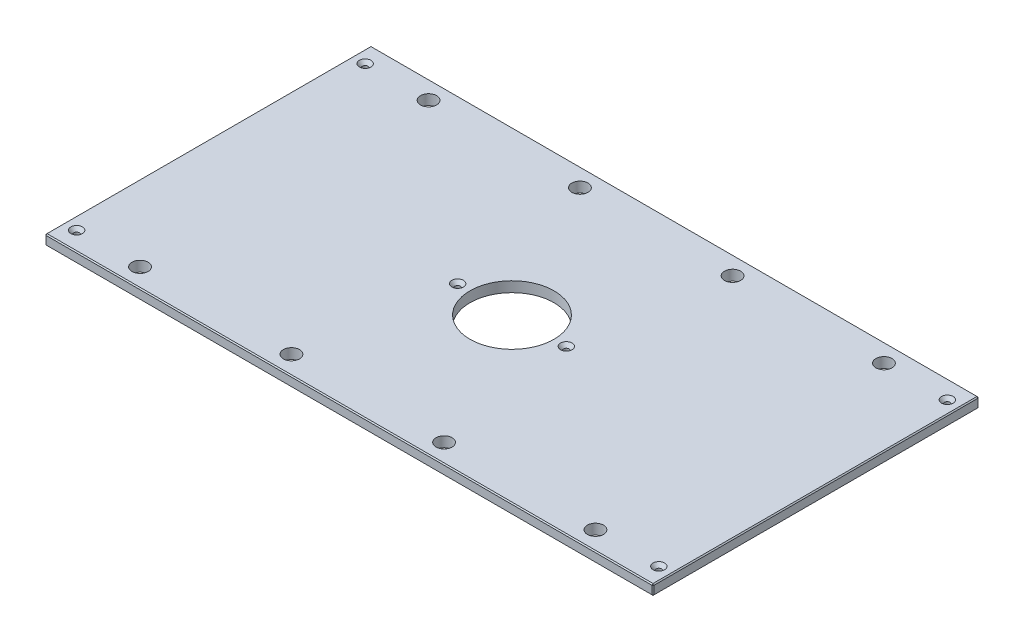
ISO-10303-21;
HEADER;
FILE_DESCRIPTION(('STEP AP214'),'2;1');
FILE_NAME('part.step','',(''),(''),'','','');
FILE_SCHEMA(('AUTOMOTIVE_DESIGN { 1 0 10303 214 1 1 1 1 }'));
ENDSEC;
DATA;
#1=APPLICATION_CONTEXT('core data for automotive mechanical design processes');
#2=APPLICATION_PROTOCOL_DEFINITION('international standard','automotive_design',2000,#1);
#3=PRODUCT_CONTEXT('',#1,'mechanical');
#4=PRODUCT('Part','Part','',(#3));
#5=PRODUCT_RELATED_PRODUCT_CATEGORY('part','',(#4));
#6=PRODUCT_DEFINITION_FORMATION('','',#4);
#7=PRODUCT_DEFINITION_CONTEXT('part definition',#1,'design');
#8=PRODUCT_DEFINITION('design','',#6,#7);
#9=PRODUCT_DEFINITION_SHAPE('','',#8);
#10=(LENGTH_UNIT() NAMED_UNIT(*) SI_UNIT(.MILLI.,.METRE.));
#11=(NAMED_UNIT(*) PLANE_ANGLE_UNIT() SI_UNIT($,.RADIAN.));
#12=(NAMED_UNIT(*) SI_UNIT($,.STERADIAN.) SOLID_ANGLE_UNIT());
#13=UNCERTAINTY_MEASURE_WITH_UNIT(LENGTH_MEASURE(1.E-05),#10,'distance_accuracy_value','');
#14=(GEOMETRIC_REPRESENTATION_CONTEXT(3) GLOBAL_UNCERTAINTY_ASSIGNED_CONTEXT((#13)) GLOBAL_UNIT_ASSIGNED_CONTEXT((#10,
#11,#12)) REPRESENTATION_CONTEXT('',''));
#15=CARTESIAN_POINT('',(0.,0.,0.));
#16=DIRECTION('',(0.,0.,1.));
#17=DIRECTION('',(1.,0.,0.));
#18=AXIS2_PLACEMENT_3D('',#15,#16,#17);
#19=CARTESIAN_POINT('',(-373.0625,12.7,-200.025));
#20=DIRECTION('',(1.,0.,0.));
#21=DIRECTION('',(0.,0.,-1.));
#22=AXIS2_PLACEMENT_3D('',#19,#20,#21);
#23=PLANE('',#22);
#24=DIRECTION('',(0.,0.,-1.));
#25=VECTOR('',#24,1.);
#26=CARTESIAN_POINT('',(-373.0625,11.43,-200.025));
#27=LINE('',#26,#25);
#28=CARTESIAN_POINT('',(-373.0625,11.43,198.755));
#29=VERTEX_POINT('',#28);
#30=CARTESIAN_POINT('',(-373.0625,11.43,-198.755));
#31=VERTEX_POINT('',#30);
#32=EDGE_CURVE('E135',#29,#31,#27,.T.);
#33=ORIENTED_EDGE('',*,*,#32,.T.);
#34=DIRECTION('',(0.,-1.,0.));
#35=VECTOR('',#34,1.);
#36=CARTESIAN_POINT('',(-373.0625,12.7,-198.755));
#37=LINE('',#36,#35);
#38=CARTESIAN_POINT('',(-373.0625,1.26999999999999,-198.755));
#39=VERTEX_POINT('',#38);
#40=EDGE_CURVE('E131',#31,#39,#37,.T.);
#41=ORIENTED_EDGE('',*,*,#40,.T.);
#42=DIRECTION('',(0.,0.,1.));
#43=VECTOR('',#42,1.);
#44=CARTESIAN_POINT('',(-373.0625,1.26999999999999,-200.025));
#45=LINE('',#44,#43);
#46=CARTESIAN_POINT('',(-373.0625,1.26999999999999,198.755));
#47=VERTEX_POINT('',#46);
#48=EDGE_CURVE('E126',#39,#47,#45,.T.);
#49=ORIENTED_EDGE('',*,*,#48,.T.);
#50=DIRECTION('',(0.,1.,0.));
#51=VECTOR('',#50,1.);
#52=CARTESIAN_POINT('',(-373.0625,12.7,198.755));
#53=LINE('',#52,#51);
#54=EDGE_CURVE('E128',#47,#29,#53,.T.);
#55=ORIENTED_EDGE('',*,*,#54,.T.);
#56=EDGE_LOOP('',(#33,#41,#49,#55));
#57=FACE_BOUND('',#56,.T.);
#58=ADVANCED_FACE('F35',(#57),#23,.F.);
#59=CARTESIAN_POINT('',(-373.0625,12.7,200.025));
#60=DIRECTION('',(0.,0.,-1.));
#61=DIRECTION('',(-1.,0.,0.));
#62=AXIS2_PLACEMENT_3D('',#59,#60,#61);
#63=PLANE('',#62);
#64=DIRECTION('',(1.,0.,0.));
#65=VECTOR('',#64,1.);
#66=CARTESIAN_POINT('',(-373.0625,1.26999999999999,200.025));
#67=LINE('',#66,#65);
#68=CARTESIAN_POINT('',(-371.7925,1.26999999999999,200.025));
#69=VERTEX_POINT('',#68);
#70=CARTESIAN_POINT('',(371.7925,1.26999999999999,200.025));
#71=VERTEX_POINT('',#70);
#72=EDGE_CURVE('E58',#69,#71,#67,.T.);
#73=ORIENTED_EDGE('',*,*,#72,.T.);
#74=DIRECTION('',(0.,1.,0.));
#75=VECTOR('',#74,1.);
#76=CARTESIAN_POINT('',(371.7925,12.7,200.025));
#77=LINE('',#76,#75);
#78=CARTESIAN_POINT('',(371.7925,11.43,200.025));
#79=VERTEX_POINT('',#78);
#80=EDGE_CURVE('E11',#71,#79,#77,.T.);
#81=ORIENTED_EDGE('',*,*,#80,.T.);
#82=DIRECTION('',(-1.,0.,0.));
#83=VECTOR('',#82,1.);
#84=CARTESIAN_POINT('',(-373.0625,11.43,200.025));
#85=LINE('',#84,#83);
#86=CARTESIAN_POINT('',(-371.7925,11.43,200.025));
#87=VERTEX_POINT('',#86);
#88=EDGE_CURVE('E44',#79,#87,#85,.T.);
#89=ORIENTED_EDGE('',*,*,#88,.T.);
#90=DIRECTION('',(0.,-1.,0.));
#91=VECTOR('',#90,1.);
#92=CARTESIAN_POINT('',(-371.7925,12.7,200.025));
#93=LINE('',#92,#91);
#94=EDGE_CURVE('E303',#87,#69,#93,.T.);
#95=ORIENTED_EDGE('',*,*,#94,.T.);
#96=EDGE_LOOP('',(#73,#81,#89,#95));
#97=FACE_BOUND('',#96,.T.);
#98=ADVANCED_FACE('F372',(#97),#63,.F.);
#99=CARTESIAN_POINT('',(373.0625,12.7,-200.025));
#100=DIRECTION('',(-1.,0.,0.));
#101=DIRECTION('',(0.,0.,1.));
#102=AXIS2_PLACEMENT_3D('',#99,#100,#101);
#103=PLANE('',#102);
#104=DIRECTION('',(0.,0.,-1.));
#105=VECTOR('',#104,1.);
#106=CARTESIAN_POINT('',(373.0625,1.26999999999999,-200.025));
#107=LINE('',#106,#105);
#108=CARTESIAN_POINT('',(373.0625,1.26999999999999,198.755));
#109=VERTEX_POINT('',#108);
#110=CARTESIAN_POINT('',(373.0625,1.26999999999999,-198.755));
#111=VERTEX_POINT('',#110);
#112=EDGE_CURVE('E298',#109,#111,#107,.T.);
#113=ORIENTED_EDGE('',*,*,#112,.T.);
#114=DIRECTION('',(0.,1.,0.));
#115=VECTOR('',#114,1.);
#116=CARTESIAN_POINT('',(373.0625,12.7,-198.755));
#117=LINE('',#116,#115);
#118=CARTESIAN_POINT('',(373.0625,11.43,-198.755));
#119=VERTEX_POINT('',#118);
#120=EDGE_CURVE('E300',#111,#119,#117,.T.);
#121=ORIENTED_EDGE('',*,*,#120,.T.);
#122=DIRECTION('',(0.,0.,1.));
#123=VECTOR('',#122,1.);
#124=CARTESIAN_POINT('',(373.0625,11.43,200.025));
#125=LINE('',#124,#123);
#126=CARTESIAN_POINT('',(373.0625,11.43,198.755));
#127=VERTEX_POINT('',#126);
#128=EDGE_CURVE('E296',#119,#127,#125,.T.);
#129=ORIENTED_EDGE('',*,*,#128,.T.);
#130=DIRECTION('',(0.,-1.,0.));
#131=VECTOR('',#130,1.);
#132=CARTESIAN_POINT('',(373.0625,12.7,198.755));
#133=LINE('',#132,#131);
#134=EDGE_CURVE('E294',#127,#109,#133,.T.);
#135=ORIENTED_EDGE('',*,*,#134,.T.);
#136=EDGE_LOOP('',(#113,#121,#129,#135));
#137=FACE_BOUND('',#136,.T.);
#138=ADVANCED_FACE('F359',(#137),#103,.F.);
#139=CARTESIAN_POINT('',(-373.0625,12.7,-200.025));
#140=DIRECTION('',(0.,0.,1.));
#141=DIRECTION('',(1.,0.,0.));
#142=AXIS2_PLACEMENT_3D('',#139,#140,#141);
#143=PLANE('',#142);
#144=DIRECTION('',(-1.,0.,0.));
#145=VECTOR('',#144,1.);
#146=CARTESIAN_POINT('',(-373.0625,1.26999999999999,-200.025));
#147=LINE('',#146,#145);
#148=CARTESIAN_POINT('',(371.7925,1.26999999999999,-200.025));
#149=VERTEX_POINT('',#148);
#150=CARTESIAN_POINT('',(-371.7925,1.26999999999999,-200.025));
#151=VERTEX_POINT('',#150);
#152=EDGE_CURVE('E270',#149,#151,#147,.T.);
#153=ORIENTED_EDGE('',*,*,#152,.T.);
#154=DIRECTION('',(0.,1.,0.));
#155=VECTOR('',#154,1.);
#156=CARTESIAN_POINT('',(-371.7925,12.7,-200.025));
#157=LINE('',#156,#155);
#158=CARTESIAN_POINT('',(-371.7925,11.43,-200.025));
#159=VERTEX_POINT('',#158);
#160=EDGE_CURVE('E274',#151,#159,#157,.T.);
#161=ORIENTED_EDGE('',*,*,#160,.T.);
#162=DIRECTION('',(1.,0.,0.));
#163=VECTOR('',#162,1.);
#164=CARTESIAN_POINT('',(373.0625,11.43,-200.025));
#165=LINE('',#164,#163);
#166=CARTESIAN_POINT('',(371.7925,11.43,-200.025));
#167=VERTEX_POINT('',#166);
#168=EDGE_CURVE('E272',#159,#167,#165,.T.);
#169=ORIENTED_EDGE('',*,*,#168,.T.);
#170=DIRECTION('',(0.,-1.,0.));
#171=VECTOR('',#170,1.);
#172=CARTESIAN_POINT('',(371.7925,12.7,-200.025));
#173=LINE('',#172,#171);
#174=EDGE_CURVE('E268',#167,#149,#173,.T.);
#175=ORIENTED_EDGE('',*,*,#174,.T.);
#176=EDGE_LOOP('',(#153,#161,#169,#175));
#177=FACE_BOUND('',#176,.T.);
#178=ADVANCED_FACE('F333',(#177),#143,.F.);
#179=CARTESIAN_POINT('',(0.,12.7,0.));
#180=DIRECTION('',(0.,1.,0.));
#181=DIRECTION('',(0.,0.,1.));
#182=AXIS2_PLACEMENT_3D('',#179,#180,#181);
#183=PLANE('',#182);
#184=CARTESIAN_POINT('',(357.1875,12.7,-177.00498));
#185=DIRECTION('',(0.,1.,0.));
#186=DIRECTION('',(0.,0.,1.));
#187=AXIS2_PLACEMENT_3D('',#184,#185,#186);
#188=CIRCLE('',#187,7.13740000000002);
#189=CARTESIAN_POINT('',(357.1875,12.7,-169.86758));
#190=VERTEX_POINT('',#189);
#191=EDGE_CURVE('E816',#190,#190,#188,.T.);
#192=ORIENTED_EDGE('',*,*,#191,.F.);
#193=EDGE_LOOP('',(#192));
#194=FACE_BOUND('',#193,.T.);
#195=CARTESIAN_POINT('',(357.1875,12.7,177.00498));
#196=DIRECTION('',(0.,1.,0.));
#197=DIRECTION('',(0.,0.,1.));
#198=AXIS2_PLACEMENT_3D('',#195,#196,#197);
#199=CIRCLE('',#198,7.13740000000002);
#200=CARTESIAN_POINT('',(357.1875,12.7,184.14238));
#201=VERTEX_POINT('',#200);
#202=EDGE_CURVE('E820',#201,#201,#199,.T.);
#203=ORIENTED_EDGE('',*,*,#202,.F.);
#204=EDGE_LOOP('',(#203));
#205=FACE_BOUND('',#204,.T.);
#206=CARTESIAN_POINT('',(-357.1875,12.7,177.00498));
#207=DIRECTION('',(0.,1.,0.));
#208=DIRECTION('',(0.,0.,1.));
#209=AXIS2_PLACEMENT_3D('',#206,#207,#208);
#210=CIRCLE('',#209,7.13740000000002);
#211=CARTESIAN_POINT('',(-357.1875,12.7,184.14238));
#212=VERTEX_POINT('',#211);
#213=EDGE_CURVE('E824',#212,#212,#210,.T.);
#214=ORIENTED_EDGE('',*,*,#213,.F.);
#215=EDGE_LOOP('',(#214));
#216=FACE_BOUND('',#215,.T.);
#217=CARTESIAN_POINT('',(-66.675,12.7,0.));
#218=DIRECTION('',(0.,1.,0.));
#219=DIRECTION('',(0.,0.,1.));
#220=AXIS2_PLACEMENT_3D('',#217,#218,#219);
#221=CIRCLE('',#220,7.1374);
#222=CARTESIAN_POINT('',(-66.675,12.7,7.1374));
#223=VERTEX_POINT('',#222);
#224=EDGE_CURVE('E828',#223,#223,#221,.T.);
#225=ORIENTED_EDGE('',*,*,#224,.F.);
#226=EDGE_LOOP('',(#225));
#227=FACE_BOUND('',#226,.T.);
#228=CARTESIAN_POINT('',(66.675,12.7,0.));
#229=DIRECTION('',(0.,1.,0.));
#230=DIRECTION('',(0.,0.,1.));
#231=AXIS2_PLACEMENT_3D('',#228,#229,#230);
#232=CIRCLE('',#231,7.1374);
#233=CARTESIAN_POINT('',(66.675,12.7,7.1374));
#234=VERTEX_POINT('',#233);
#235=EDGE_CURVE('E832',#234,#234,#232,.T.);
#236=ORIENTED_EDGE('',*,*,#235,.F.);
#237=EDGE_LOOP('',(#236));
#238=FACE_BOUND('',#237,.T.);
#239=CARTESIAN_POINT('',(-357.1875,12.7,-177.00498));
#240=DIRECTION('',(0.,1.,0.));
#241=DIRECTION('',(0.,0.,1.));
#242=AXIS2_PLACEMENT_3D('',#239,#240,#241);
#243=CIRCLE('',#242,7.13740000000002);
#244=CARTESIAN_POINT('',(-357.1875,12.7,-169.86758));
#245=VERTEX_POINT('',#244);
#246=EDGE_CURVE('E835',#245,#245,#243,.T.);
#247=ORIENTED_EDGE('',*,*,#246,.F.);
#248=EDGE_LOOP('',(#247));
#249=FACE_BOUND('',#248,.T.);
#250=DIRECTION('',(0.,0.,-1.));
#251=VECTOR('',#250,1.);
#252=CARTESIAN_POINT('',(371.7925,12.7,-200.025));
#253=LINE('',#252,#251);
#254=CARTESIAN_POINT('',(371.7925,12.7,198.755));
#255=VERTEX_POINT('',#254);
#256=CARTESIAN_POINT('',(371.7925,12.7,-198.755));
#257=VERTEX_POINT('',#256);
#258=EDGE_CURVE('E281',#255,#257,#253,.T.);
#259=ORIENTED_EDGE('',*,*,#258,.T.);
#260=DIRECTION('',(-1.,0.,0.));
#261=VECTOR('',#260,1.);
#262=CARTESIAN_POINT('',(-373.0625,12.7,-198.755));
#263=LINE('',#262,#261);
#264=CARTESIAN_POINT('',(-371.7925,12.7,-198.755));
#265=VERTEX_POINT('',#264);
#266=EDGE_CURVE('E283',#257,#265,#263,.T.);
#267=ORIENTED_EDGE('',*,*,#266,.T.);
#268=DIRECTION('',(0.,0.,1.));
#269=VECTOR('',#268,1.);
#270=CARTESIAN_POINT('',(-371.7925,12.7,200.025));
#271=LINE('',#270,#269);
#272=CARTESIAN_POINT('',(-371.7925,12.7,198.755));
#273=VERTEX_POINT('',#272);
#274=EDGE_CURVE('E279',#265,#273,#271,.T.);
#275=ORIENTED_EDGE('',*,*,#274,.T.);
#276=DIRECTION('',(1.,0.,0.));
#277=VECTOR('',#276,1.);
#278=CARTESIAN_POINT('',(373.0625,12.7,198.755));
#279=LINE('',#278,#277);
#280=EDGE_CURVE('E277',#273,#255,#279,.T.);
#281=ORIENTED_EDGE('',*,*,#280,.T.);
#282=EDGE_LOOP('',(#259,#267,#275,#281));
#283=FACE_BOUND('',#282,.T.);
#284=CARTESIAN_POINT('',(279.4,12.7,-177.00498));
#285=DIRECTION('',(0.,1.,0.));
#286=DIRECTION('',(0.,0.,1.));
#287=AXIS2_PLACEMENT_3D('',#284,#285,#286);
#288=CIRCLE('',#287,9.92187500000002);
#289=CARTESIAN_POINT('',(279.4,12.7,-167.083105));
#290=VERTEX_POINT('',#289);
#291=EDGE_CURVE('E204',#290,#290,#288,.T.);
#292=ORIENTED_EDGE('',*,*,#291,.F.);
#293=EDGE_LOOP('',(#292));
#294=FACE_BOUND('',#293,.T.);
#295=CARTESIAN_POINT('',(-279.4,12.7,-177.00498));
#296=DIRECTION('',(0.,1.,0.));
#297=DIRECTION('',(0.,0.,1.));
#298=AXIS2_PLACEMENT_3D('',#295,#296,#297);
#299=CIRCLE('',#298,9.92187500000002);
#300=CARTESIAN_POINT('',(-279.4,12.7,-167.083105));
#301=VERTEX_POINT('',#300);
#302=EDGE_CURVE('E214',#301,#301,#299,.T.);
#303=ORIENTED_EDGE('',*,*,#302,.F.);
#304=EDGE_LOOP('',(#303));
#305=FACE_BOUND('',#304,.T.);
#306=CARTESIAN_POINT('',(279.4,12.7,177.00498));
#307=DIRECTION('',(0.,1.,0.));
#308=DIRECTION('',(0.,0.,1.));
#309=AXIS2_PLACEMENT_3D('',#306,#307,#308);
#310=CIRCLE('',#309,9.92187500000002);
#311=CARTESIAN_POINT('',(279.4,12.7,186.926855));
#312=VERTEX_POINT('',#311);
#313=EDGE_CURVE('E225',#312,#312,#310,.T.);
#314=ORIENTED_EDGE('',*,*,#313,.F.);
#315=EDGE_LOOP('',(#314));
#316=FACE_BOUND('',#315,.T.);
#317=CARTESIAN_POINT('',(-279.4,12.7,177.00498));
#318=DIRECTION('',(0.,1.,0.));
#319=DIRECTION('',(0.,0.,1.));
#320=AXIS2_PLACEMENT_3D('',#317,#318,#319);
#321=CIRCLE('',#320,9.92187500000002);
#322=CARTESIAN_POINT('',(-279.4,12.7,186.926855));
#323=VERTEX_POINT('',#322);
#324=EDGE_CURVE('E231',#323,#323,#321,.T.);
#325=ORIENTED_EDGE('',*,*,#324,.F.);
#326=EDGE_LOOP('',(#325));
#327=FACE_BOUND('',#326,.T.);
#328=CARTESIAN_POINT('',(-93.6625,12.7,-177.00498));
#329=DIRECTION('',(0.,1.,0.));
#330=DIRECTION('',(0.,0.,1.));
#331=AXIS2_PLACEMENT_3D('',#328,#329,#330);
#332=CIRCLE('',#331,9.921875);
#333=CARTESIAN_POINT('',(-93.6625,12.7,-167.083105));
#334=VERTEX_POINT('',#333);
#335=EDGE_CURVE('E237',#334,#334,#332,.T.);
#336=ORIENTED_EDGE('',*,*,#335,.F.);
#337=EDGE_LOOP('',(#336));
#338=FACE_BOUND('',#337,.T.);
#339=CARTESIAN_POINT('',(93.6625,12.7,-177.00498));
#340=DIRECTION('',(0.,1.,0.));
#341=DIRECTION('',(0.,0.,1.));
#342=AXIS2_PLACEMENT_3D('',#339,#340,#341);
#343=CIRCLE('',#342,9.921875);
#344=CARTESIAN_POINT('',(93.6625,12.7,-167.083105));
#345=VERTEX_POINT('',#344);
#346=EDGE_CURVE('E243',#345,#345,#343,.T.);
#347=ORIENTED_EDGE('',*,*,#346,.F.);
#348=EDGE_LOOP('',(#347));
#349=FACE_BOUND('',#348,.T.);
#350=CARTESIAN_POINT('',(93.6625,12.7,177.00498));
#351=DIRECTION('',(0.,1.,0.));
#352=DIRECTION('',(0.,0.,1.));
#353=AXIS2_PLACEMENT_3D('',#350,#351,#352);
#354=CIRCLE('',#353,9.921875);
#355=CARTESIAN_POINT('',(93.6625,12.7,186.926855));
#356=VERTEX_POINT('',#355);
#357=EDGE_CURVE('E249',#356,#356,#354,.T.);
#358=ORIENTED_EDGE('',*,*,#357,.F.);
#359=EDGE_LOOP('',(#358));
#360=FACE_BOUND('',#359,.T.);
#361=CARTESIAN_POINT('',(-93.6625,12.7,177.00498));
#362=DIRECTION('',(0.,1.,0.));
#363=DIRECTION('',(0.,0.,1.));
#364=AXIS2_PLACEMENT_3D('',#361,#362,#363);
#365=CIRCLE('',#364,9.921875);
#366=CARTESIAN_POINT('',(-93.6625,12.7,186.926855));
#367=VERTEX_POINT('',#366);
#368=EDGE_CURVE('E255',#367,#367,#365,.T.);
#369=ORIENTED_EDGE('',*,*,#368,.F.);
#370=EDGE_LOOP('',(#369));
#371=FACE_BOUND('',#370,.T.);
#372=CARTESIAN_POINT('',(0.,12.7,0.));
#373=DIRECTION('',(0.,1.,0.));
#374=DIRECTION('',(0.,0.,1.));
#375=AXIS2_PLACEMENT_3D('',#372,#373,#374);
#376=CIRCLE('',#375,51.562);
#377=CARTESIAN_POINT('',(0.,12.7,51.562));
#378=VERTEX_POINT('',#377);
#379=EDGE_CURVE('E261',#378,#378,#376,.T.);
#380=ORIENTED_EDGE('',*,*,#379,.F.);
#381=EDGE_LOOP('',(#380));
#382=FACE_BOUND('',#381,.T.);
#383=ADVANCED_FACE('F381',(#194,#205,#216,#227,#238,#249,#283,#294,#305,#316,#327,#338,#349,
#360,#371,#382),#183,.T.);
#384=CARTESIAN_POINT('',(0.,0.,0.));
#385=DIRECTION('',(0.,1.,0.));
#386=DIRECTION('',(0.,0.,1.));
#387=AXIS2_PLACEMENT_3D('',#384,#385,#386);
#388=PLANE('',#387);
#389=CARTESIAN_POINT('',(357.1875,0.,-177.00498));
#390=DIRECTION('',(0.,1.,0.));
#391=DIRECTION('',(0.,0.,1.));
#392=AXIS2_PLACEMENT_3D('',#389,#390,#391);
#393=CIRCLE('',#392,3.3782);
#394=CARTESIAN_POINT('',(357.1875,0.,-173.62678));
#395=VERTEX_POINT('',#394);
#396=EDGE_CURVE('E869',#395,#395,#393,.T.);
#397=ORIENTED_EDGE('',*,*,#396,.T.);
#398=EDGE_LOOP('',(#397));
#399=FACE_BOUND('',#398,.T.);
#400=CARTESIAN_POINT('',(357.1875,0.,177.00498));
#401=DIRECTION('',(0.,1.,0.));
#402=DIRECTION('',(0.,0.,1.));
#403=AXIS2_PLACEMENT_3D('',#400,#401,#402);
#404=CIRCLE('',#403,3.3782);
#405=CARTESIAN_POINT('',(357.1875,0.,180.38318));
#406=VERTEX_POINT('',#405);
#407=EDGE_CURVE('E862',#406,#406,#404,.T.);
#408=ORIENTED_EDGE('',*,*,#407,.T.);
#409=EDGE_LOOP('',(#408));
#410=FACE_BOUND('',#409,.T.);
#411=CARTESIAN_POINT('',(-357.1875,0.,177.00498));
#412=DIRECTION('',(0.,1.,0.));
#413=DIRECTION('',(0.,0.,1.));
#414=AXIS2_PLACEMENT_3D('',#411,#412,#413);
#415=CIRCLE('',#414,3.3782);
#416=CARTESIAN_POINT('',(-357.1875,0.,180.38318));
#417=VERTEX_POINT('',#416);
#418=EDGE_CURVE('E855',#417,#417,#415,.T.);
#419=ORIENTED_EDGE('',*,*,#418,.T.);
#420=EDGE_LOOP('',(#419));
#421=FACE_BOUND('',#420,.T.);
#422=CARTESIAN_POINT('',(-66.675,0.,0.));
#423=DIRECTION('',(0.,1.,0.));
#424=DIRECTION('',(0.,0.,1.));
#425=AXIS2_PLACEMENT_3D('',#422,#423,#424);
#426=CIRCLE('',#425,3.3782);
#427=CARTESIAN_POINT('',(-66.675,0.,3.3782));
#428=VERTEX_POINT('',#427);
#429=EDGE_CURVE('E848',#428,#428,#426,.T.);
#430=ORIENTED_EDGE('',*,*,#429,.T.);
#431=EDGE_LOOP('',(#430));
#432=FACE_BOUND('',#431,.T.);
#433=CARTESIAN_POINT('',(66.675,0.,0.));
#434=DIRECTION('',(0.,1.,0.));
#435=DIRECTION('',(0.,0.,1.));
#436=AXIS2_PLACEMENT_3D('',#433,#434,#435);
#437=CIRCLE('',#436,3.3782);
#438=CARTESIAN_POINT('',(66.675,0.,3.3782));
#439=VERTEX_POINT('',#438);
#440=EDGE_CURVE('E838',#439,#439,#437,.T.);
#441=ORIENTED_EDGE('',*,*,#440,.T.);
#442=EDGE_LOOP('',(#441));
#443=FACE_BOUND('',#442,.T.);
#444=CARTESIAN_POINT('',(-357.1875,0.,-177.00498));
#445=DIRECTION('',(0.,1.,0.));
#446=DIRECTION('',(0.,0.,1.));
#447=AXIS2_PLACEMENT_3D('',#444,#445,#446);
#448=CIRCLE('',#447,3.3782);
#449=CARTESIAN_POINT('',(-357.1875,0.,-173.62678));
#450=VERTEX_POINT('',#449);
#451=EDGE_CURVE('E217',#450,#450,#448,.T.);
#452=ORIENTED_EDGE('',*,*,#451,.T.);
#453=EDGE_LOOP('',(#452));
#454=FACE_BOUND('',#453,.T.);
#455=DIRECTION('',(0.,0.,-1.));
#456=VECTOR('',#455,1.);
#457=CARTESIAN_POINT('',(-371.7925,0.,0.));
#458=LINE('',#457,#456);
#459=CARTESIAN_POINT('',(-371.7925,0.,198.755));
#460=VERTEX_POINT('',#459);
#461=CARTESIAN_POINT('',(-371.7925,0.,-198.755));
#462=VERTEX_POINT('',#461);
#463=EDGE_CURVE('E158',#460,#462,#458,.T.);
#464=ORIENTED_EDGE('',*,*,#463,.T.);
#465=DIRECTION('',(1.,0.,0.));
#466=VECTOR('',#465,1.);
#467=CARTESIAN_POINT('',(0.,0.,-198.755));
#468=LINE('',#467,#466);
#469=CARTESIAN_POINT('',(371.7925,0.,-198.755));
#470=VERTEX_POINT('',#469);
#471=EDGE_CURVE('E291',#462,#470,#468,.T.);
#472=ORIENTED_EDGE('',*,*,#471,.T.);
#473=DIRECTION('',(0.,0.,1.));
#474=VECTOR('',#473,1.);
#475=CARTESIAN_POINT('',(371.7925,0.,0.));
#476=LINE('',#475,#474);
#477=CARTESIAN_POINT('',(371.7925,0.,198.755));
#478=VERTEX_POINT('',#477);
#479=EDGE_CURVE('E289',#470,#478,#476,.T.);
#480=ORIENTED_EDGE('',*,*,#479,.T.);
#481=DIRECTION('',(-1.,0.,0.));
#482=VECTOR('',#481,1.);
#483=CARTESIAN_POINT('',(0.,0.,198.755));
#484=LINE('',#483,#482);
#485=EDGE_CURVE('E286',#478,#460,#484,.T.);
#486=ORIENTED_EDGE('',*,*,#485,.T.);
#487=EDGE_LOOP('',(#464,#472,#480,#486));
#488=FACE_BOUND('',#487,.T.);
#489=CARTESIAN_POINT('',(279.4,0.,-177.00498));
#490=DIRECTION('',(0.,1.,0.));
#491=DIRECTION('',(0.,0.,1.));
#492=AXIS2_PLACEMENT_3D('',#489,#490,#491);
#493=CIRCLE('',#492,9.92187500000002);
#494=CARTESIAN_POINT('',(279.4,0.,-167.083105));
#495=VERTEX_POINT('',#494);
#496=EDGE_CURVE('E209',#495,#495,#493,.T.);
#497=ORIENTED_EDGE('',*,*,#496,.T.);
#498=EDGE_LOOP('',(#497));
#499=FACE_BOUND('',#498,.T.);
#500=CARTESIAN_POINT('',(-279.4,0.,-177.00498));
#501=DIRECTION('',(0.,1.,0.));
#502=DIRECTION('',(0.,0.,1.));
#503=AXIS2_PLACEMENT_3D('',#500,#501,#502);
#504=CIRCLE('',#503,9.92187500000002);
#505=CARTESIAN_POINT('',(-279.4,0.,-167.083105));
#506=VERTEX_POINT('',#505);
#507=EDGE_CURVE('E222',#506,#506,#504,.T.);
#508=ORIENTED_EDGE('',*,*,#507,.T.);
#509=EDGE_LOOP('',(#508));
#510=FACE_BOUND('',#509,.T.);
#511=CARTESIAN_POINT('',(279.4,0.,177.00498));
#512=DIRECTION('',(0.,1.,0.));
#513=DIRECTION('',(0.,0.,1.));
#514=AXIS2_PLACEMENT_3D('',#511,#512,#513);
#515=CIRCLE('',#514,9.92187500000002);
#516=CARTESIAN_POINT('',(279.4,0.,186.926855));
#517=VERTEX_POINT('',#516);
#518=EDGE_CURVE('E228',#517,#517,#515,.T.);
#519=ORIENTED_EDGE('',*,*,#518,.T.);
#520=EDGE_LOOP('',(#519));
#521=FACE_BOUND('',#520,.T.);
#522=CARTESIAN_POINT('',(-279.4,0.,177.00498));
#523=DIRECTION('',(0.,1.,0.));
#524=DIRECTION('',(0.,0.,1.));
#525=AXIS2_PLACEMENT_3D('',#522,#523,#524);
#526=CIRCLE('',#525,9.92187500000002);
#527=CARTESIAN_POINT('',(-279.4,0.,186.926855));
#528=VERTEX_POINT('',#527);
#529=EDGE_CURVE('E234',#528,#528,#526,.T.);
#530=ORIENTED_EDGE('',*,*,#529,.T.);
#531=EDGE_LOOP('',(#530));
#532=FACE_BOUND('',#531,.T.);
#533=CARTESIAN_POINT('',(-93.6625,0.,-177.00498));
#534=DIRECTION('',(0.,1.,0.));
#535=DIRECTION('',(0.,0.,1.));
#536=AXIS2_PLACEMENT_3D('',#533,#534,#535);
#537=CIRCLE('',#536,9.921875);
#538=CARTESIAN_POINT('',(-93.6625,0.,-167.083105));
#539=VERTEX_POINT('',#538);
#540=EDGE_CURVE('E240',#539,#539,#537,.T.);
#541=ORIENTED_EDGE('',*,*,#540,.T.);
#542=EDGE_LOOP('',(#541));
#543=FACE_BOUND('',#542,.T.);
#544=CARTESIAN_POINT('',(93.6625,0.,-177.00498));
#545=DIRECTION('',(0.,1.,0.));
#546=DIRECTION('',(0.,0.,1.));
#547=AXIS2_PLACEMENT_3D('',#544,#545,#546);
#548=CIRCLE('',#547,9.921875);
#549=CARTESIAN_POINT('',(93.6625,0.,-167.083105));
#550=VERTEX_POINT('',#549);
#551=EDGE_CURVE('E246',#550,#550,#548,.T.);
#552=ORIENTED_EDGE('',*,*,#551,.T.);
#553=EDGE_LOOP('',(#552));
#554=FACE_BOUND('',#553,.T.);
#555=CARTESIAN_POINT('',(93.6625,0.,177.00498));
#556=DIRECTION('',(0.,1.,0.));
#557=DIRECTION('',(0.,0.,1.));
#558=AXIS2_PLACEMENT_3D('',#555,#556,#557);
#559=CIRCLE('',#558,9.921875);
#560=CARTESIAN_POINT('',(93.6625,0.,186.926855));
#561=VERTEX_POINT('',#560);
#562=EDGE_CURVE('E252',#561,#561,#559,.T.);
#563=ORIENTED_EDGE('',*,*,#562,.T.);
#564=EDGE_LOOP('',(#563));
#565=FACE_BOUND('',#564,.T.);
#566=CARTESIAN_POINT('',(-93.6625,0.,177.00498));
#567=DIRECTION('',(0.,1.,0.));
#568=DIRECTION('',(0.,0.,1.));
#569=AXIS2_PLACEMENT_3D('',#566,#567,#568);
#570=CIRCLE('',#569,9.921875);
#571=CARTESIAN_POINT('',(-93.6625,0.,186.926855));
#572=VERTEX_POINT('',#571);
#573=EDGE_CURVE('E258',#572,#572,#570,.T.);
#574=ORIENTED_EDGE('',*,*,#573,.T.);
#575=EDGE_LOOP('',(#574));
#576=FACE_BOUND('',#575,.T.);
#577=CARTESIAN_POINT('',(0.,0.,0.));
#578=DIRECTION('',(0.,1.,0.));
#579=DIRECTION('',(0.,0.,1.));
#580=AXIS2_PLACEMENT_3D('',#577,#578,#579);
#581=CIRCLE('',#580,51.562);
#582=CARTESIAN_POINT('',(0.,0.,51.562));
#583=VERTEX_POINT('',#582);
#584=EDGE_CURVE('E147',#583,#583,#581,.T.);
#585=ORIENTED_EDGE('',*,*,#584,.T.);
#586=EDGE_LOOP('',(#585));
#587=FACE_BOUND('',#586,.T.);
#588=ADVANCED_FACE('F346',(#399,#410,#421,#432,#443,#454,#488,#499,#510,#521,#532,#543,#554,
#565,#576,#587),#388,.F.);
#589=CARTESIAN_POINT('',(0.,0.,0.));
#590=DIRECTION('',(0.,1.,0.));
#591=DIRECTION('',(0.,0.,1.));
#592=AXIS2_PLACEMENT_3D('',#589,#590,#591);
#593=CYLINDRICAL_SURFACE('',#592,51.562);
#594=ORIENTED_EDGE('',*,*,#584,.F.);
#595=EDGE_LOOP('',(#594));
#596=FACE_BOUND('',#595,.T.);
#597=ORIENTED_EDGE('',*,*,#379,.T.);
#598=EDGE_LOOP('',(#597));
#599=FACE_BOUND('',#598,.T.);
#600=ADVANCED_FACE('F751',(#596,#599),#593,.F.);
#601=CARTESIAN_POINT('',(-93.6625,12.7,177.00498));
#602=DIRECTION('',(0.,1.,0.));
#603=DIRECTION('',(0.,0.,1.));
#604=AXIS2_PLACEMENT_3D('',#601,#602,#603);
#605=CYLINDRICAL_SURFACE('',#604,9.921875);
#606=ORIENTED_EDGE('',*,*,#573,.F.);
#607=EDGE_LOOP('',(#606));
#608=FACE_BOUND('',#607,.T.);
#609=ORIENTED_EDGE('',*,*,#368,.T.);
#610=EDGE_LOOP('',(#609));
#611=FACE_BOUND('',#610,.T.);
#612=ADVANCED_FACE('F742',(#608,#611),#605,.F.);
#613=CARTESIAN_POINT('',(93.6625,12.7,177.00498));
#614=DIRECTION('',(0.,1.,0.));
#615=DIRECTION('',(0.,0.,1.));
#616=AXIS2_PLACEMENT_3D('',#613,#614,#615);
#617=CYLINDRICAL_SURFACE('',#616,9.921875);
#618=ORIENTED_EDGE('',*,*,#562,.F.);
#619=EDGE_LOOP('',(#618));
#620=FACE_BOUND('',#619,.T.);
#621=ORIENTED_EDGE('',*,*,#357,.T.);
#622=EDGE_LOOP('',(#621));
#623=FACE_BOUND('',#622,.T.);
#624=ADVANCED_FACE('F733',(#620,#623),#617,.F.);
#625=CARTESIAN_POINT('',(93.6625,12.7,-177.00498));
#626=DIRECTION('',(0.,1.,0.));
#627=DIRECTION('',(0.,0.,1.));
#628=AXIS2_PLACEMENT_3D('',#625,#626,#627);
#629=CYLINDRICAL_SURFACE('',#628,9.921875);
#630=ORIENTED_EDGE('',*,*,#551,.F.);
#631=EDGE_LOOP('',(#630));
#632=FACE_BOUND('',#631,.T.);
#633=ORIENTED_EDGE('',*,*,#346,.T.);
#634=EDGE_LOOP('',(#633));
#635=FACE_BOUND('',#634,.T.);
#636=ADVANCED_FACE('F724',(#632,#635),#629,.F.);
#637=CARTESIAN_POINT('',(-93.6625,12.7,-177.00498));
#638=DIRECTION('',(0.,1.,0.));
#639=DIRECTION('',(0.,0.,1.));
#640=AXIS2_PLACEMENT_3D('',#637,#638,#639);
#641=CYLINDRICAL_SURFACE('',#640,9.921875);
#642=ORIENTED_EDGE('',*,*,#540,.F.);
#643=EDGE_LOOP('',(#642));
#644=FACE_BOUND('',#643,.T.);
#645=ORIENTED_EDGE('',*,*,#335,.T.);
#646=EDGE_LOOP('',(#645));
#647=FACE_BOUND('',#646,.T.);
#648=ADVANCED_FACE('F715',(#644,#647),#641,.F.);
#649=CARTESIAN_POINT('',(-279.4,12.7,177.00498));
#650=DIRECTION('',(0.,1.,0.));
#651=DIRECTION('',(0.,0.,1.));
#652=AXIS2_PLACEMENT_3D('',#649,#650,#651);
#653=CYLINDRICAL_SURFACE('',#652,9.92187500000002);
#654=ORIENTED_EDGE('',*,*,#529,.F.);
#655=EDGE_LOOP('',(#654));
#656=FACE_BOUND('',#655,.T.);
#657=ORIENTED_EDGE('',*,*,#324,.T.);
#658=EDGE_LOOP('',(#657));
#659=FACE_BOUND('',#658,.T.);
#660=ADVANCED_FACE('F706',(#656,#659),#653,.F.);
#661=CARTESIAN_POINT('',(279.4,12.7,177.00498));
#662=DIRECTION('',(0.,1.,0.));
#663=DIRECTION('',(0.,0.,1.));
#664=AXIS2_PLACEMENT_3D('',#661,#662,#663);
#665=CYLINDRICAL_SURFACE('',#664,9.92187500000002);
#666=ORIENTED_EDGE('',*,*,#518,.F.);
#667=EDGE_LOOP('',(#666));
#668=FACE_BOUND('',#667,.T.);
#669=ORIENTED_EDGE('',*,*,#313,.T.);
#670=EDGE_LOOP('',(#669));
#671=FACE_BOUND('',#670,.T.);
#672=ADVANCED_FACE('F697',(#668,#671),#665,.F.);
#673=CARTESIAN_POINT('',(-279.4,12.7,-177.00498));
#674=DIRECTION('',(0.,1.,0.));
#675=DIRECTION('',(0.,0.,1.));
#676=AXIS2_PLACEMENT_3D('',#673,#674,#675);
#677=CYLINDRICAL_SURFACE('',#676,9.92187500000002);
#678=ORIENTED_EDGE('',*,*,#507,.F.);
#679=EDGE_LOOP('',(#678));
#680=FACE_BOUND('',#679,.T.);
#681=ORIENTED_EDGE('',*,*,#302,.T.);
#682=EDGE_LOOP('',(#681));
#683=FACE_BOUND('',#682,.T.);
#684=ADVANCED_FACE('F687',(#680,#683),#677,.F.);
#685=CARTESIAN_POINT('',(279.4,12.7,-177.00498));
#686=DIRECTION('',(0.,1.,0.));
#687=DIRECTION('',(0.,0.,1.));
#688=AXIS2_PLACEMENT_3D('',#685,#686,#687);
#689=CYLINDRICAL_SURFACE('',#688,9.92187500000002);
#690=ORIENTED_EDGE('',*,*,#496,.F.);
#691=EDGE_LOOP('',(#690));
#692=FACE_BOUND('',#691,.T.);
#693=ORIENTED_EDGE('',*,*,#291,.T.);
#694=EDGE_LOOP('',(#693));
#695=FACE_BOUND('',#694,.T.);
#696=ADVANCED_FACE('F390',(#692,#695),#689,.F.);
#697=CARTESIAN_POINT('',(373.0625,12.7,198.755));
#698=DIRECTION('',(-0.707106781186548,0.,-0.707106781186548));
#699=DIRECTION('',(0.,-1.,0.));
#700=AXIS2_PLACEMENT_3D('',#697,#698,#699);
#701=PLANE('',#700);
#702=DIRECTION('',(-0.707106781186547,0.,0.707106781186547));
#703=VECTOR('',#702,1.);
#704=CARTESIAN_POINT('',(373.0625,11.43,198.755));
#705=LINE('',#704,#703);
#706=EDGE_CURVE('E39',#79,#127,#705,.F.);
#707=ORIENTED_EDGE('',*,*,#706,.F.);
#708=ORIENTED_EDGE('',*,*,#80,.F.);
#709=DIRECTION('',(0.707106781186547,0.,-0.707106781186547));
#710=VECTOR('',#709,1.);
#711=CARTESIAN_POINT('',(372.4275,1.26999999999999,199.39));
#712=LINE('',#711,#710);
#713=EDGE_CURVE('E197',#109,#71,#712,.F.);
#714=ORIENTED_EDGE('',*,*,#713,.F.);
#715=ORIENTED_EDGE('',*,*,#134,.F.);
#716=EDGE_LOOP('',(#707,#708,#714,#715));
#717=FACE_BOUND('',#716,.T.);
#718=ADVANCED_FACE('F37',(#717),#701,.F.);
#719=CARTESIAN_POINT('',(373.0625,11.43,198.755));
#720=DIRECTION('',(0.577350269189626,0.577350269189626,0.577350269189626));
#721=DIRECTION('',(0.707106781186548,0.,-0.707106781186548));
#722=AXIS2_PLACEMENT_3D('',#719,#720,#721);
#723=PLANE('',#722);
#724=DIRECTION('',(0.,-0.707106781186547,0.707106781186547));
#725=VECTOR('',#724,1.);
#726=CARTESIAN_POINT('',(371.7925,12.065,199.39));
#727=LINE('',#726,#725);
#728=EDGE_CURVE('E193',#79,#255,#727,.F.);
#729=ORIENTED_EDGE('',*,*,#728,.F.);
#730=ORIENTED_EDGE('',*,*,#706,.T.);
#731=DIRECTION('',(-0.707106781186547,0.707106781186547,0.));
#732=VECTOR('',#731,1.);
#733=CARTESIAN_POINT('',(373.0625,11.43,198.755));
#734=LINE('',#733,#732);
#735=EDGE_CURVE('E195',#255,#127,#734,.F.);
#736=ORIENTED_EDGE('',*,*,#735,.F.);
#737=EDGE_LOOP('',(#729,#730,#736));
#738=FACE_BOUND('',#737,.T.);
#739=ADVANCED_FACE('F383',(#738),#723,.T.);
#740=CARTESIAN_POINT('',(371.7925,0.,198.755));
#741=DIRECTION('',(0.577350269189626,-0.577350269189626,0.577350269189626));
#742=DIRECTION('',(0.707106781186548,0.,-0.707106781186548));
#743=AXIS2_PLACEMENT_3D('',#740,#741,#742);
#744=PLANE('',#743);
#745=DIRECTION('',(-0.707106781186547,-0.707106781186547,0.));
#746=VECTOR('',#745,1.);
#747=CARTESIAN_POINT('',(371.7925,0.,198.755));
#748=LINE('',#747,#746);
#749=EDGE_CURVE('E187',#109,#478,#748,.T.);
#750=ORIENTED_EDGE('',*,*,#749,.F.);
#751=ORIENTED_EDGE('',*,*,#713,.T.);
#752=DIRECTION('',(0.,0.707106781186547,0.707106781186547));
#753=VECTOR('',#752,1.);
#754=CARTESIAN_POINT('',(371.7925,0.,198.755));
#755=LINE('',#754,#753);
#756=EDGE_CURVE('E190',#478,#71,#755,.T.);
#757=ORIENTED_EDGE('',*,*,#756,.F.);
#758=EDGE_LOOP('',(#750,#751,#757));
#759=FACE_BOUND('',#758,.T.);
#760=ADVANCED_FACE('F352',(#759),#744,.T.);
#761=CARTESIAN_POINT('',(371.7925,12.7,0.));
#762=DIRECTION('',(0.707106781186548,0.707106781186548,0.));
#763=DIRECTION('',(0.,0.,1.));
#764=AXIS2_PLACEMENT_3D('',#761,#762,#763);
#765=PLANE('',#764);
#766=ORIENTED_EDGE('',*,*,#735,.T.);
#767=ORIENTED_EDGE('',*,*,#128,.F.);
#768=DIRECTION('',(0.707106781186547,-0.707106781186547,0.));
#769=VECTOR('',#768,1.);
#770=CARTESIAN_POINT('',(372.4275,12.065,-198.755));
#771=LINE('',#770,#769);
#772=EDGE_CURVE('E182',#257,#119,#771,.T.);
#773=ORIENTED_EDGE('',*,*,#772,.F.);
#774=ORIENTED_EDGE('',*,*,#258,.F.);
#775=EDGE_LOOP('',(#766,#767,#773,#774));
#776=FACE_BOUND('',#775,.T.);
#777=ADVANCED_FACE('F369',(#776),#765,.T.);
#778=CARTESIAN_POINT('',(0.,12.7,198.755));
#779=DIRECTION('',(0.,0.707106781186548,0.707106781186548));
#780=DIRECTION('',(-1.,0.,0.));
#781=AXIS2_PLACEMENT_3D('',#778,#779,#780);
#782=PLANE('',#781);
#783=ORIENTED_EDGE('',*,*,#728,.T.);
#784=ORIENTED_EDGE('',*,*,#280,.F.);
#785=DIRECTION('',(0.,0.707106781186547,-0.707106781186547));
#786=VECTOR('',#785,1.);
#787=CARTESIAN_POINT('',(-371.7925,12.7,198.755));
#788=LINE('',#787,#786);
#789=EDGE_CURVE('E179',#87,#273,#788,.T.);
#790=ORIENTED_EDGE('',*,*,#789,.F.);
#791=ORIENTED_EDGE('',*,*,#88,.F.);
#792=EDGE_LOOP('',(#783,#784,#790,#791));
#793=FACE_BOUND('',#792,.T.);
#794=ADVANCED_FACE('F374',(#793),#782,.T.);
#795=CARTESIAN_POINT('',(-371.7925,12.7,200.025));
#796=DIRECTION('',(0.707106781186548,0.,-0.707106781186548));
#797=DIRECTION('',(0.,-1.,0.));
#798=AXIS2_PLACEMENT_3D('',#795,#796,#797);
#799=PLANE('',#798);
#800=DIRECTION('',(0.707106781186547,0.,0.707106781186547));
#801=VECTOR('',#800,1.);
#802=CARTESIAN_POINT('',(-373.0625,1.26999999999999,198.755));
#803=LINE('',#802,#801);
#804=EDGE_CURVE('E142',#69,#47,#803,.F.);
#805=ORIENTED_EDGE('',*,*,#804,.F.);
#806=ORIENTED_EDGE('',*,*,#94,.F.);
#807=DIRECTION('',(-0.707106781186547,0.,-0.707106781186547));
#808=VECTOR('',#807,1.);
#809=CARTESIAN_POINT('',(-372.4275,11.43,199.39));
#810=LINE('',#809,#808);
#811=EDGE_CURVE('E145',#29,#87,#810,.F.);
#812=ORIENTED_EDGE('',*,*,#811,.F.);
#813=ORIENTED_EDGE('',*,*,#54,.F.);
#814=EDGE_LOOP('',(#805,#806,#812,#813));
#815=FACE_BOUND('',#814,.T.);
#816=ADVANCED_FACE('F140',(#815),#799,.F.);
#817=CARTESIAN_POINT('',(-373.0625,1.26999999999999,200.025));
#818=DIRECTION('',(0.,0.707106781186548,-0.707106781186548));
#819=DIRECTION('',(1.,0.,0.));
#820=AXIS2_PLACEMENT_3D('',#817,#818,#819);
#821=PLANE('',#820);
#822=ORIENTED_EDGE('',*,*,#756,.T.);
#823=ORIENTED_EDGE('',*,*,#72,.F.);
#824=DIRECTION('',(0.,-0.707106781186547,-0.707106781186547));
#825=VECTOR('',#824,1.);
#826=CARTESIAN_POINT('',(-371.7925,0.634999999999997,199.39));
#827=LINE('',#826,#825);
#828=EDGE_CURVE('E155',#460,#69,#827,.F.);
#829=ORIENTED_EDGE('',*,*,#828,.F.);
#830=ORIENTED_EDGE('',*,*,#485,.F.);
#831=EDGE_LOOP('',(#822,#823,#829,#830));
#832=FACE_BOUND('',#831,.T.);
#833=ADVANCED_FACE('F351',(#832),#821,.F.);
#834=CARTESIAN_POINT('',(373.0625,1.26999999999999,-200.025));
#835=DIRECTION('',(-0.707106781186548,0.707106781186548,0.));
#836=DIRECTION('',(0.,0.,-1.));
#837=AXIS2_PLACEMENT_3D('',#834,#835,#836);
#838=PLANE('',#837);
#839=ORIENTED_EDGE('',*,*,#749,.T.);
#840=ORIENTED_EDGE('',*,*,#479,.F.);
#841=DIRECTION('',(0.707106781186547,0.707106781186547,0.));
#842=VECTOR('',#841,1.);
#843=CARTESIAN_POINT('',(371.7925,0.,-198.755));
#844=LINE('',#843,#842);
#845=EDGE_CURVE('E174',#111,#470,#844,.F.);
#846=ORIENTED_EDGE('',*,*,#845,.F.);
#847=ORIENTED_EDGE('',*,*,#112,.F.);
#848=EDGE_LOOP('',(#839,#840,#846,#847));
#849=FACE_BOUND('',#848,.T.);
#850=ADVANCED_FACE('F356',(#849),#838,.F.);
#851=CARTESIAN_POINT('',(371.7925,12.7,-200.025));
#852=DIRECTION('',(-0.707106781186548,0.,0.707106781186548));
#853=DIRECTION('',(0.,-1.,0.));
#854=AXIS2_PLACEMENT_3D('',#851,#852,#853);
#855=PLANE('',#854);
#856=DIRECTION('',(0.707106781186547,0.,0.707106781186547));
#857=VECTOR('',#856,1.);
#858=CARTESIAN_POINT('',(371.7925,11.43,-200.025));
#859=LINE('',#858,#857);
#860=EDGE_CURVE('E184',#119,#167,#859,.F.);
#861=ORIENTED_EDGE('',*,*,#860,.F.);
#862=ORIENTED_EDGE('',*,*,#120,.F.);
#863=DIRECTION('',(-0.707106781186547,0.,-0.707106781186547));
#864=VECTOR('',#863,1.);
#865=CARTESIAN_POINT('',(372.4275,1.26999999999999,-199.39));
#866=LINE('',#865,#864);
#867=EDGE_CURVE('E171',#149,#111,#866,.F.);
#868=ORIENTED_EDGE('',*,*,#867,.F.);
#869=ORIENTED_EDGE('',*,*,#174,.F.);
#870=EDGE_LOOP('',(#861,#862,#868,#869));
#871=FACE_BOUND('',#870,.T.);
#872=ADVANCED_FACE('F364',(#871),#855,.F.);
#873=CARTESIAN_POINT('',(371.7925,11.43,-200.025));
#874=DIRECTION('',(0.577350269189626,0.577350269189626,-0.577350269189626));
#875=DIRECTION('',(-0.707106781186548,0.,-0.707106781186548));
#876=AXIS2_PLACEMENT_3D('',#873,#874,#875);
#877=PLANE('',#876);
#878=ORIENTED_EDGE('',*,*,#772,.T.);
#879=ORIENTED_EDGE('',*,*,#860,.T.);
#880=DIRECTION('',(0.,0.707106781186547,0.707106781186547));
#881=VECTOR('',#880,1.);
#882=CARTESIAN_POINT('',(371.7925,11.43,-200.025));
#883=LINE('',#882,#881);
#884=EDGE_CURVE('E163',#257,#167,#883,.F.);
#885=ORIENTED_EDGE('',*,*,#884,.F.);
#886=EDGE_LOOP('',(#878,#879,#885));
#887=FACE_BOUND('',#886,.T.);
#888=ADVANCED_FACE('F422',(#887),#877,.T.);
#889=CARTESIAN_POINT('',(-371.7925,12.7,198.755));
#890=DIRECTION('',(-0.577350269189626,0.577350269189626,0.577350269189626));
#891=DIRECTION('',(0.707106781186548,0.,0.707106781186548));
#892=AXIS2_PLACEMENT_3D('',#889,#890,#891);
#893=PLANE('',#892);
#894=ORIENTED_EDGE('',*,*,#811,.T.);
#895=ORIENTED_EDGE('',*,*,#789,.T.);
#896=DIRECTION('',(-0.707106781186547,-0.707106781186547,0.));
#897=VECTOR('',#896,1.);
#898=CARTESIAN_POINT('',(-371.7925,12.7,198.755));
#899=LINE('',#898,#897);
#900=EDGE_CURVE('E159',#29,#273,#899,.F.);
#901=ORIENTED_EDGE('',*,*,#900,.F.);
#902=EDGE_LOOP('',(#894,#895,#901));
#903=FACE_BOUND('',#902,.T.);
#904=ADVANCED_FACE('F376',(#903),#893,.T.);
#905=CARTESIAN_POINT('',(-373.0625,1.26999999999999,198.755));
#906=DIRECTION('',(-0.577350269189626,-0.577350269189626,0.577350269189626));
#907=DIRECTION('',(0.707106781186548,0.,0.707106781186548));
#908=AXIS2_PLACEMENT_3D('',#905,#906,#907);
#909=PLANE('',#908);
#910=ORIENTED_EDGE('',*,*,#828,.T.);
#911=ORIENTED_EDGE('',*,*,#804,.T.);
#912=DIRECTION('',(-0.707106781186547,0.707106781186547,0.));
#913=VECTOR('',#912,1.);
#914=CARTESIAN_POINT('',(-373.0625,1.26999999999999,198.755));
#915=LINE('',#914,#913);
#916=EDGE_CURVE('E152',#460,#47,#915,.T.);
#917=ORIENTED_EDGE('',*,*,#916,.F.);
#918=EDGE_LOOP('',(#910,#911,#917));
#919=FACE_BOUND('',#918,.T.);
#920=ADVANCED_FACE('F151',(#919),#909,.T.);
#921=CARTESIAN_POINT('',(371.7925,0.,-198.755));
#922=DIRECTION('',(0.577350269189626,-0.577350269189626,-0.577350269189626));
#923=DIRECTION('',(-0.707106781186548,0.,-0.707106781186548));
#924=AXIS2_PLACEMENT_3D('',#921,#922,#923);
#925=PLANE('',#924);
#926=ORIENTED_EDGE('',*,*,#867,.T.);
#927=ORIENTED_EDGE('',*,*,#845,.T.);
#928=DIRECTION('',(0.,-0.707106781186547,0.707106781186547));
#929=VECTOR('',#928,1.);
#930=CARTESIAN_POINT('',(371.7925,0.,-198.755));
#931=LINE('',#930,#929);
#932=EDGE_CURVE('E160',#149,#470,#931,.T.);
#933=ORIENTED_EDGE('',*,*,#932,.F.);
#934=EDGE_LOOP('',(#926,#927,#933));
#935=FACE_BOUND('',#934,.T.);
#936=ADVANCED_FACE('F414',(#935),#925,.T.);
#937=CARTESIAN_POINT('',(0.,12.7,-198.755));
#938=DIRECTION('',(0.,0.707106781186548,-0.707106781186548));
#939=DIRECTION('',(1.,0.,0.));
#940=AXIS2_PLACEMENT_3D('',#937,#938,#939);
#941=PLANE('',#940);
#942=ORIENTED_EDGE('',*,*,#884,.T.);
#943=ORIENTED_EDGE('',*,*,#168,.F.);
#944=DIRECTION('',(0.,-0.707106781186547,-0.707106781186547));
#945=VECTOR('',#944,1.);
#946=CARTESIAN_POINT('',(-371.7925,11.43,-200.025));
#947=LINE('',#946,#945);
#948=EDGE_CURVE('E165',#265,#159,#947,.T.);
#949=ORIENTED_EDGE('',*,*,#948,.F.);
#950=ORIENTED_EDGE('',*,*,#266,.F.);
#951=EDGE_LOOP('',(#942,#943,#949,#950));
#952=FACE_BOUND('',#951,.T.);
#953=ADVANCED_FACE('F328',(#952),#941,.T.);
#954=CARTESIAN_POINT('',(-371.7925,12.7,0.));
#955=DIRECTION('',(-0.707106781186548,0.707106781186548,0.));
#956=DIRECTION('',(0.,0.,-1.));
#957=AXIS2_PLACEMENT_3D('',#954,#955,#956);
#958=PLANE('',#957);
#959=ORIENTED_EDGE('',*,*,#900,.T.);
#960=ORIENTED_EDGE('',*,*,#274,.F.);
#961=DIRECTION('',(0.707106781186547,0.707106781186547,0.));
#962=VECTOR('',#961,1.);
#963=CARTESIAN_POINT('',(-372.4275,12.065,-198.755));
#964=LINE('',#963,#962);
#965=EDGE_CURVE('E317',#31,#265,#964,.T.);
#966=ORIENTED_EDGE('',*,*,#965,.F.);
#967=ORIENTED_EDGE('',*,*,#32,.F.);
#968=EDGE_LOOP('',(#959,#960,#966,#967));
#969=FACE_BOUND('',#968,.T.);
#970=ADVANCED_FACE('F379',(#969),#958,.T.);
#971=CARTESIAN_POINT('',(-373.0625,1.26999999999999,-200.025));
#972=DIRECTION('',(0.707106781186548,0.707106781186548,0.));
#973=DIRECTION('',(0.,0.,1.));
#974=AXIS2_PLACEMENT_3D('',#971,#972,#973);
#975=PLANE('',#974);
#976=ORIENTED_EDGE('',*,*,#916,.T.);
#977=ORIENTED_EDGE('',*,*,#48,.F.);
#978=DIRECTION('',(0.707106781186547,-0.707106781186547,0.));
#979=VECTOR('',#978,1.);
#980=CARTESIAN_POINT('',(-373.0625,1.26999999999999,-198.755));
#981=LINE('',#980,#979);
#982=EDGE_CURVE('E314',#462,#39,#981,.F.);
#983=ORIENTED_EDGE('',*,*,#982,.F.);
#984=ORIENTED_EDGE('',*,*,#463,.F.);
#985=EDGE_LOOP('',(#976,#977,#983,#984));
#986=FACE_BOUND('',#985,.T.);
#987=ADVANCED_FACE('F157',(#986),#975,.F.);
#988=CARTESIAN_POINT('',(-373.0625,1.26999999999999,-200.025));
#989=DIRECTION('',(0.,0.707106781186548,0.707106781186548));
#990=DIRECTION('',(-1.,0.,0.));
#991=AXIS2_PLACEMENT_3D('',#988,#989,#990);
#992=PLANE('',#991);
#993=ORIENTED_EDGE('',*,*,#932,.T.);
#994=ORIENTED_EDGE('',*,*,#471,.F.);
#995=DIRECTION('',(0.,0.707106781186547,-0.707106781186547));
#996=VECTOR('',#995,1.);
#997=CARTESIAN_POINT('',(-371.7925,0.634999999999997,-199.39));
#998=LINE('',#997,#996);
#999=EDGE_CURVE('E311',#151,#462,#998,.F.);
#1000=ORIENTED_EDGE('',*,*,#999,.F.);
#1001=ORIENTED_EDGE('',*,*,#152,.F.);
#1002=EDGE_LOOP('',(#993,#994,#1000,#1001));
#1003=FACE_BOUND('',#1002,.T.);
#1004=ADVANCED_FACE('F343',(#1003),#992,.F.);
#1005=CARTESIAN_POINT('',(-371.7925,11.43,-200.025));
#1006=DIRECTION('',(-0.577350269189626,0.577350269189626,-0.577350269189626));
#1007=DIRECTION('',(-0.707106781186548,0.,0.707106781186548));
#1008=AXIS2_PLACEMENT_3D('',#1005,#1006,#1007);
#1009=PLANE('',#1008);
#1010=ORIENTED_EDGE('',*,*,#965,.T.);
#1011=ORIENTED_EDGE('',*,*,#948,.T.);
#1012=DIRECTION('',(0.707106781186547,0.,-0.707106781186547));
#1013=VECTOR('',#1012,1.);
#1014=CARTESIAN_POINT('',(-371.7925,11.43,-200.025));
#1015=LINE('',#1014,#1013);
#1016=EDGE_CURVE('E309',#31,#159,#1015,.T.);
#1017=ORIENTED_EDGE('',*,*,#1016,.F.);
#1018=EDGE_LOOP('',(#1010,#1011,#1017));
#1019=FACE_BOUND('',#1018,.T.);
#1020=ADVANCED_FACE('F323',(#1019),#1009,.T.);
#1021=CARTESIAN_POINT('',(-373.0625,1.26999999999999,-198.755));
#1022=DIRECTION('',(-0.577350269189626,-0.577350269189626,-0.577350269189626));
#1023=DIRECTION('',(-0.707106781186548,0.,0.707106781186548));
#1024=AXIS2_PLACEMENT_3D('',#1021,#1022,#1023);
#1025=PLANE('',#1024);
#1026=ORIENTED_EDGE('',*,*,#999,.T.);
#1027=ORIENTED_EDGE('',*,*,#982,.T.);
#1028=DIRECTION('',(-0.707106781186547,0.,0.707106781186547));
#1029=VECTOR('',#1028,1.);
#1030=CARTESIAN_POINT('',(-373.0625,1.26999999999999,-198.755));
#1031=LINE('',#1030,#1029);
#1032=EDGE_CURVE('E307',#151,#39,#1031,.T.);
#1033=ORIENTED_EDGE('',*,*,#1032,.F.);
#1034=EDGE_LOOP('',(#1026,#1027,#1033));
#1035=FACE_BOUND('',#1034,.T.);
#1036=ADVANCED_FACE('F340',(#1035),#1025,.T.);
#1037=CARTESIAN_POINT('',(-373.0625,12.7,-198.755));
#1038=DIRECTION('',(0.707106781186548,0.,0.707106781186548));
#1039=DIRECTION('',(0.,-1.,0.));
#1040=AXIS2_PLACEMENT_3D('',#1037,#1038,#1039);
#1041=PLANE('',#1040);
#1042=ORIENTED_EDGE('',*,*,#1016,.T.);
#1043=ORIENTED_EDGE('',*,*,#160,.F.);
#1044=ORIENTED_EDGE('',*,*,#1032,.T.);
#1045=ORIENTED_EDGE('',*,*,#40,.F.);
#1046=EDGE_LOOP('',(#1042,#1043,#1044,#1045));
#1047=FACE_BOUND('',#1046,.T.);
#1048=ADVANCED_FACE('F338',(#1047),#1041,.F.);
#1049=CARTESIAN_POINT('',(-357.1875,12.7,-177.00498));
#1050=DIRECTION('',(0.,1.,0.));
#1051=DIRECTION('',(0.,0.,1.));
#1052=AXIS2_PLACEMENT_3D('',#1049,#1050,#1051);
#1053=CYLINDRICAL_SURFACE('',#1052,3.3782);
#1054=ORIENTED_EDGE('',*,*,#451,.F.);
#1055=EDGE_LOOP('',(#1054));
#1056=FACE_BOUND('',#1055,.T.);
#1057=CARTESIAN_POINT('',(-357.1875,8.37553508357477,-177.00498));
#1058=DIRECTION('',(0.,1.,0.));
#1059=DIRECTION('',(0.,0.,1.));
#1060=AXIS2_PLACEMENT_3D('',#1057,#1058,#1059);
#1061=CIRCLE('',#1060,3.3782);
#1062=CARTESIAN_POINT('',(-357.1875,8.37553508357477,-173.62678));
#1063=VERTEX_POINT('',#1062);
#1064=EDGE_CURVE('E837',#1063,#1063,#1061,.T.);
#1065=ORIENTED_EDGE('',*,*,#1064,.T.);
#1066=EDGE_LOOP('',(#1065));
#1067=FACE_BOUND('',#1066,.T.);
#1068=ADVANCED_FACE('F401',(#1056,#1067),#1053,.F.);
#1069=CARTESIAN_POINT('',(-357.1875,12.7,-177.00498));
#1070=DIRECTION('',(0.,1.,0.));
#1071=DIRECTION('',(0.,0.,1.));
#1072=AXIS2_PLACEMENT_3D('',#1069,#1070,#1071);
#1073=CONICAL_SURFACE('',#1072,7.13740000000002,0.715584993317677);
#1074=ORIENTED_EDGE('',*,*,#1064,.F.);
#1075=EDGE_LOOP('',(#1074));
#1076=FACE_BOUND('',#1075,.T.);
#1077=ORIENTED_EDGE('',*,*,#246,.T.);
#1078=EDGE_LOOP('',(#1077));
#1079=FACE_BOUND('',#1078,.T.);
#1080=ADVANCED_FACE('F511',(#1076,#1079),#1073,.F.);
#1081=CARTESIAN_POINT('',(66.675,12.7,0.));
#1082=DIRECTION('',(0.,1.,0.));
#1083=DIRECTION('',(0.,0.,1.));
#1084=AXIS2_PLACEMENT_3D('',#1081,#1082,#1083);
#1085=CYLINDRICAL_SURFACE('',#1084,3.3782);
#1086=ORIENTED_EDGE('',*,*,#440,.F.);
#1087=EDGE_LOOP('',(#1086));
#1088=FACE_BOUND('',#1087,.T.);
#1089=CARTESIAN_POINT('',(66.675,8.37553508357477,0.));
#1090=DIRECTION('',(0.,1.,0.));
#1091=DIRECTION('',(0.,0.,1.));
#1092=AXIS2_PLACEMENT_3D('',#1089,#1090,#1091);
#1093=CIRCLE('',#1092,3.3782);
#1094=CARTESIAN_POINT('',(66.675,8.37553508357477,3.3782));
#1095=VERTEX_POINT('',#1094);
#1096=EDGE_CURVE('E842',#1095,#1095,#1093,.T.);
#1097=ORIENTED_EDGE('',*,*,#1096,.T.);
#1098=EDGE_LOOP('',(#1097));
#1099=FACE_BOUND('',#1098,.T.);
#1100=ADVANCED_FACE('F520',(#1088,#1099),#1085,.F.);
#1101=CARTESIAN_POINT('',(66.675,12.7,0.));
#1102=DIRECTION('',(0.,1.,0.));
#1103=DIRECTION('',(0.,0.,1.));
#1104=AXIS2_PLACEMENT_3D('',#1101,#1102,#1103);
#1105=CONICAL_SURFACE('',#1104,7.1374,0.715584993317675);
#1106=ORIENTED_EDGE('',*,*,#1096,.F.);
#1107=EDGE_LOOP('',(#1106));
#1108=FACE_BOUND('',#1107,.T.);
#1109=ORIENTED_EDGE('',*,*,#235,.T.);
#1110=EDGE_LOOP('',(#1109));
#1111=FACE_BOUND('',#1110,.T.);
#1112=ADVANCED_FACE('F528',(#1108,#1111),#1105,.F.);
#1113=CARTESIAN_POINT('',(-66.675,12.7,0.));
#1114=DIRECTION('',(0.,1.,0.));
#1115=DIRECTION('',(0.,0.,1.));
#1116=AXIS2_PLACEMENT_3D('',#1113,#1114,#1115);
#1117=CYLINDRICAL_SURFACE('',#1116,3.3782);
#1118=ORIENTED_EDGE('',*,*,#429,.F.);
#1119=EDGE_LOOP('',(#1118));
#1120=FACE_BOUND('',#1119,.T.);
#1121=CARTESIAN_POINT('',(-66.675,8.37553508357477,0.));
#1122=DIRECTION('',(0.,1.,0.));
#1123=DIRECTION('',(0.,0.,1.));
#1124=AXIS2_PLACEMENT_3D('',#1121,#1122,#1123);
#1125=CIRCLE('',#1124,3.3782);
#1126=CARTESIAN_POINT('',(-66.675,8.37553508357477,3.3782));
#1127=VERTEX_POINT('',#1126);
#1128=EDGE_CURVE('E851',#1127,#1127,#1125,.T.);
#1129=ORIENTED_EDGE('',*,*,#1128,.T.);
#1130=EDGE_LOOP('',(#1129));
#1131=FACE_BOUND('',#1130,.T.);
#1132=ADVANCED_FACE('F536',(#1120,#1131),#1117,.F.);
#1133=CARTESIAN_POINT('',(-66.675,12.7,0.));
#1134=DIRECTION('',(0.,1.,0.));
#1135=DIRECTION('',(0.,0.,1.));
#1136=AXIS2_PLACEMENT_3D('',#1133,#1134,#1135);
#1137=CONICAL_SURFACE('',#1136,7.1374,0.715584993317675);
#1138=ORIENTED_EDGE('',*,*,#1128,.F.);
#1139=EDGE_LOOP('',(#1138));
#1140=FACE_BOUND('',#1139,.T.);
#1141=ORIENTED_EDGE('',*,*,#224,.T.);
#1142=EDGE_LOOP('',(#1141));
#1143=FACE_BOUND('',#1142,.T.);
#1144=ADVANCED_FACE('F544',(#1140,#1143),#1137,.F.);
#1145=CARTESIAN_POINT('',(-357.1875,12.7,177.00498));
#1146=DIRECTION('',(0.,1.,0.));
#1147=DIRECTION('',(0.,0.,1.));
#1148=AXIS2_PLACEMENT_3D('',#1145,#1146,#1147);
#1149=CYLINDRICAL_SURFACE('',#1148,3.3782);
#1150=ORIENTED_EDGE('',*,*,#418,.F.);
#1151=EDGE_LOOP('',(#1150));
#1152=FACE_BOUND('',#1151,.T.);
#1153=CARTESIAN_POINT('',(-357.1875,8.37553508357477,177.00498));
#1154=DIRECTION('',(0.,1.,0.));
#1155=DIRECTION('',(0.,0.,1.));
#1156=AXIS2_PLACEMENT_3D('',#1153,#1154,#1155);
#1157=CIRCLE('',#1156,3.3782);
#1158=CARTESIAN_POINT('',(-357.1875,8.37553508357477,180.38318));
#1159=VERTEX_POINT('',#1158);
#1160=EDGE_CURVE('E858',#1159,#1159,#1157,.T.);
#1161=ORIENTED_EDGE('',*,*,#1160,.T.);
#1162=EDGE_LOOP('',(#1161));
#1163=FACE_BOUND('',#1162,.T.);
#1164=ADVANCED_FACE('F552',(#1152,#1163),#1149,.F.);
#1165=CARTESIAN_POINT('',(-357.1875,12.7,177.00498));
#1166=DIRECTION('',(0.,1.,0.));
#1167=DIRECTION('',(0.,0.,1.));
#1168=AXIS2_PLACEMENT_3D('',#1165,#1166,#1167);
#1169=CONICAL_SURFACE('',#1168,7.13740000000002,0.715584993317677);
#1170=ORIENTED_EDGE('',*,*,#1160,.F.);
#1171=EDGE_LOOP('',(#1170));
#1172=FACE_BOUND('',#1171,.T.);
#1173=ORIENTED_EDGE('',*,*,#213,.T.);
#1174=EDGE_LOOP('',(#1173));
#1175=FACE_BOUND('',#1174,.T.);
#1176=ADVANCED_FACE('F560',(#1172,#1175),#1169,.F.);
#1177=CARTESIAN_POINT('',(357.1875,12.7,177.00498));
#1178=DIRECTION('',(0.,1.,0.));
#1179=DIRECTION('',(0.,0.,1.));
#1180=AXIS2_PLACEMENT_3D('',#1177,#1178,#1179);
#1181=CYLINDRICAL_SURFACE('',#1180,3.3782);
#1182=ORIENTED_EDGE('',*,*,#407,.F.);
#1183=EDGE_LOOP('',(#1182));
#1184=FACE_BOUND('',#1183,.T.);
#1185=CARTESIAN_POINT('',(357.1875,8.37553508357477,177.00498));
#1186=DIRECTION('',(0.,1.,0.));
#1187=DIRECTION('',(0.,0.,1.));
#1188=AXIS2_PLACEMENT_3D('',#1185,#1186,#1187);
#1189=CIRCLE('',#1188,3.3782);
#1190=CARTESIAN_POINT('',(357.1875,8.37553508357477,180.38318));
#1191=VERTEX_POINT('',#1190);
#1192=EDGE_CURVE('E865',#1191,#1191,#1189,.T.);
#1193=ORIENTED_EDGE('',*,*,#1192,.T.);
#1194=EDGE_LOOP('',(#1193));
#1195=FACE_BOUND('',#1194,.T.);
#1196=ADVANCED_FACE('F568',(#1184,#1195),#1181,.F.);
#1197=CARTESIAN_POINT('',(357.1875,12.7,177.00498));
#1198=DIRECTION('',(0.,1.,0.));
#1199=DIRECTION('',(0.,0.,1.));
#1200=AXIS2_PLACEMENT_3D('',#1197,#1198,#1199);
#1201=CONICAL_SURFACE('',#1200,7.13740000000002,0.715584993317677);
#1202=ORIENTED_EDGE('',*,*,#1192,.F.);
#1203=EDGE_LOOP('',(#1202));
#1204=FACE_BOUND('',#1203,.T.);
#1205=ORIENTED_EDGE('',*,*,#202,.T.);
#1206=EDGE_LOOP('',(#1205));
#1207=FACE_BOUND('',#1206,.T.);
#1208=ADVANCED_FACE('F576',(#1204,#1207),#1201,.F.);
#1209=CARTESIAN_POINT('',(357.1875,12.7,-177.00498));
#1210=DIRECTION('',(0.,1.,0.));
#1211=DIRECTION('',(0.,0.,1.));
#1212=AXIS2_PLACEMENT_3D('',#1209,#1210,#1211);
#1213=CYLINDRICAL_SURFACE('',#1212,3.3782);
#1214=ORIENTED_EDGE('',*,*,#396,.F.);
#1215=EDGE_LOOP('',(#1214));
#1216=FACE_BOUND('',#1215,.T.);
#1217=CARTESIAN_POINT('',(357.1875,8.37553508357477,-177.00498));
#1218=DIRECTION('',(0.,1.,0.));
#1219=DIRECTION('',(0.,0.,1.));
#1220=AXIS2_PLACEMENT_3D('',#1217,#1218,#1219);
#1221=CIRCLE('',#1220,3.3782);
#1222=CARTESIAN_POINT('',(357.1875,8.37553508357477,-173.62678));
#1223=VERTEX_POINT('',#1222);
#1224=EDGE_CURVE('E872',#1223,#1223,#1221,.T.);
#1225=ORIENTED_EDGE('',*,*,#1224,.T.);
#1226=EDGE_LOOP('',(#1225));
#1227=FACE_BOUND('',#1226,.T.);
#1228=ADVANCED_FACE('F584',(#1216,#1227),#1213,.F.);
#1229=CARTESIAN_POINT('',(357.1875,12.7,-177.00498));
#1230=DIRECTION('',(0.,1.,0.));
#1231=DIRECTION('',(0.,0.,1.));
#1232=AXIS2_PLACEMENT_3D('',#1229,#1230,#1231);
#1233=CONICAL_SURFACE('',#1232,7.13740000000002,0.715584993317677);
#1234=ORIENTED_EDGE('',*,*,#1224,.F.);
#1235=EDGE_LOOP('',(#1234));
#1236=FACE_BOUND('',#1235,.T.);
#1237=ORIENTED_EDGE('',*,*,#191,.T.);
#1238=EDGE_LOOP('',(#1237));
#1239=FACE_BOUND('',#1238,.T.);
#1240=ADVANCED_FACE('F592',(#1236,#1239),#1233,.F.);
#1241=CLOSED_SHELL('',(#58,#98,#138,#178,#383,#588,#600,#612,#624,#636,#648,#660,#672,#684,#696,
#718,#739,#760,#777,#794,#816,#833,#850,#872,#888,#904,#920,#936,#953,#970,#987,#1004,#1020,
#1036,#1048,#1068,#1080,#1100,#1112,#1132,#1144,#1164,#1176,#1196,#1208,#1228,#1240));
#1242=MANIFOLD_SOLID_BREP('B2',#1241);
#1243=ADVANCED_BREP_SHAPE_REPRESENTATION('',(#18,#1242),#14);
#1244=SHAPE_DEFINITION_REPRESENTATION(#9,#1243);
ENDSEC;
END-ISO-10303-21;
